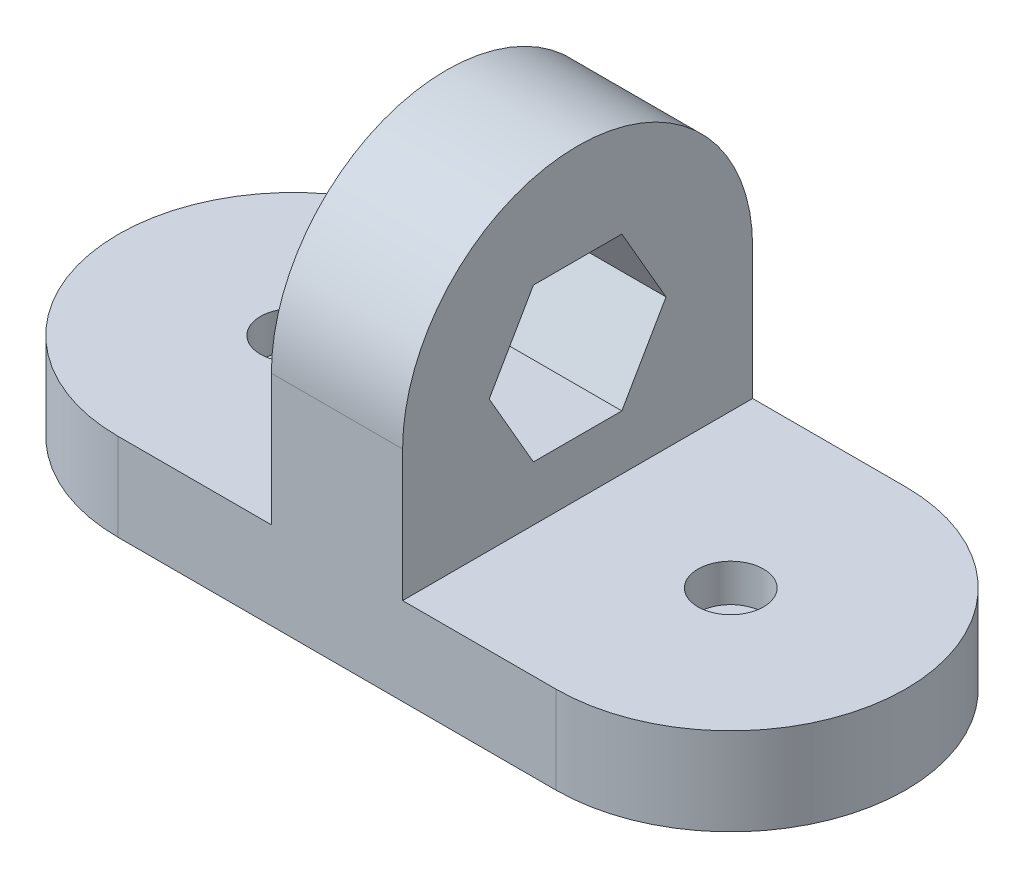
ISO-10303-21;
HEADER;
FILE_DESCRIPTION(('STEP AP214'),'2;1');
FILE_NAME('part.step','',(''),(''),'','','');
FILE_SCHEMA(('AUTOMOTIVE_DESIGN { 1 0 10303 214 1 1 1 1 }'));
ENDSEC;
DATA;
#1=APPLICATION_CONTEXT('core data for automotive mechanical design processes');
#2=APPLICATION_PROTOCOL_DEFINITION('international standard','automotive_design',2000,#1);
#3=PRODUCT_CONTEXT('',#1,'mechanical');
#4=PRODUCT('Part','Part','',(#3));
#5=PRODUCT_RELATED_PRODUCT_CATEGORY('part','',(#4));
#6=PRODUCT_DEFINITION_FORMATION('','',#4);
#7=PRODUCT_DEFINITION_CONTEXT('part definition',#1,'design');
#8=PRODUCT_DEFINITION('design','',#6,#7);
#9=PRODUCT_DEFINITION_SHAPE('','',#8);
#10=(LENGTH_UNIT() NAMED_UNIT(*) SI_UNIT(.MILLI.,.METRE.));
#11=(NAMED_UNIT(*) PLANE_ANGLE_UNIT() SI_UNIT($,.RADIAN.));
#12=(NAMED_UNIT(*) SI_UNIT($,.STERADIAN.) SOLID_ANGLE_UNIT());
#13=UNCERTAINTY_MEASURE_WITH_UNIT(LENGTH_MEASURE(1.E-05),#10,'distance_accuracy_value','');
#14=(GEOMETRIC_REPRESENTATION_CONTEXT(3) GLOBAL_UNCERTAINTY_ASSIGNED_CONTEXT((#13)) GLOBAL_UNIT_ASSIGNED_CONTEXT((#10,
#11,#12)) REPRESENTATION_CONTEXT('',''));
#15=CARTESIAN_POINT('',(0.,0.,0.));
#16=DIRECTION('',(0.,0.,1.));
#17=DIRECTION('',(1.,0.,0.));
#18=AXIS2_PLACEMENT_3D('',#15,#16,#17);
#19=CARTESIAN_POINT('',(-50.,20.,0.));
#20=DIRECTION('',(0.,1.,0.));
#21=DIRECTION('',(0.,0.,1.));
#22=AXIS2_PLACEMENT_3D('',#19,#20,#21);
#23=PLANE('',#22);
#24=CARTESIAN_POINT('',(-50.,20.,0.));
#25=DIRECTION('',(0.,1.,0.));
#26=DIRECTION('',(0.,0.,1.));
#27=AXIS2_PLACEMENT_3D('',#24,#25,#26);
#28=CIRCLE('',#27,7.49999999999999);
#29=CARTESIAN_POINT('',(-50.,20.,7.49999999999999));
#30=VERTEX_POINT('',#29);
#31=EDGE_CURVE('E213',#30,#30,#28,.T.);
#32=ORIENTED_EDGE('',*,*,#31,.F.);
#33=EDGE_LOOP('',(#32));
#34=FACE_BOUND('',#33,.T.);
#35=DIRECTION('',(1.,0.,0.));
#36=VECTOR('',#35,1.);
#37=CARTESIAN_POINT('',(-50.,20.,40.));
#38=LINE('',#37,#36);
#39=CARTESIAN_POINT('',(-50.,20.,40.));
#40=VERTEX_POINT('',#39);
#41=CARTESIAN_POINT('',(-15.,20.,40.));
#42=VERTEX_POINT('',#41);
#43=EDGE_CURVE('E243',#40,#42,#38,.T.);
#44=ORIENTED_EDGE('',*,*,#43,.T.);
#45=DIRECTION('',(0.,0.,-1.));
#46=VECTOR('',#45,1.);
#47=CARTESIAN_POINT('',(-15.,20.,-40.));
#48=LINE('',#47,#46);
#49=CARTESIAN_POINT('',(-15.,20.,-40.));
#50=VERTEX_POINT('',#49);
#51=EDGE_CURVE('E188',#42,#50,#48,.T.);
#52=ORIENTED_EDGE('',*,*,#51,.T.);
#53=DIRECTION('',(-1.,0.,0.));
#54=VECTOR('',#53,1.);
#55=CARTESIAN_POINT('',(-50.,20.,-40.));
#56=LINE('',#55,#54);
#57=CARTESIAN_POINT('',(-50.,20.,-40.));
#58=VERTEX_POINT('',#57);
#59=EDGE_CURVE('E247',#50,#58,#56,.T.);
#60=ORIENTED_EDGE('',*,*,#59,.T.);
#61=CARTESIAN_POINT('',(-50.,20.,0.));
#62=DIRECTION('',(0.,1.,0.));
#63=DIRECTION('',(0.,0.,1.));
#64=AXIS2_PLACEMENT_3D('',#61,#62,#63);
#65=CIRCLE('',#64,40.);
#66=EDGE_CURVE('E238',#58,#40,#65,.T.);
#67=ORIENTED_EDGE('',*,*,#66,.T.);
#68=EDGE_LOOP('',(#44,#52,#60,#67));
#69=FACE_BOUND('',#68,.T.);
#70=ADVANCED_FACE('F33',(#34,#69),#23,.T.);
#71=CARTESIAN_POINT('',(-50.,20.,0.));
#72=DIRECTION('',(0.,-1.,0.));
#73=DIRECTION('',(0.,0.,-1.));
#74=AXIS2_PLACEMENT_3D('',#71,#72,#73);
#75=CYLINDRICAL_SURFACE('',#74,40.);
#76=CARTESIAN_POINT('',(-50.,0.,0.));
#77=DIRECTION('',(0.,1.,0.));
#78=DIRECTION('',(0.,0.,1.));
#79=AXIS2_PLACEMENT_3D('',#76,#77,#78);
#80=CIRCLE('',#79,40.);
#81=CARTESIAN_POINT('',(-50.,0.,-40.));
#82=VERTEX_POINT('',#81);
#83=CARTESIAN_POINT('',(-50.,0.,40.));
#84=VERTEX_POINT('',#83);
#85=EDGE_CURVE('E237',#82,#84,#80,.T.);
#86=ORIENTED_EDGE('',*,*,#85,.T.);
#87=DIRECTION('',(0.,-1.,0.));
#88=VECTOR('',#87,1.);
#89=CARTESIAN_POINT('',(-50.,20.,40.));
#90=LINE('',#89,#88);
#91=EDGE_CURVE('E11',#40,#84,#90,.T.);
#92=ORIENTED_EDGE('',*,*,#91,.F.);
#93=ORIENTED_EDGE('',*,*,#66,.F.);
#94=DIRECTION('',(0.,-1.,0.));
#95=VECTOR('',#94,1.);
#96=CARTESIAN_POINT('',(-50.,20.,-40.));
#97=LINE('',#96,#95);
#98=EDGE_CURVE('E250',#58,#82,#97,.T.);
#99=ORIENTED_EDGE('',*,*,#98,.T.);
#100=EDGE_LOOP('',(#86,#92,#93,#99));
#101=FACE_BOUND('',#100,.T.);
#102=ADVANCED_FACE('F35',(#101),#75,.T.);
#103=CARTESIAN_POINT('',(-50.,20.,40.));
#104=DIRECTION('',(0.,0.,-1.));
#105=DIRECTION('',(-1.,0.,0.));
#106=AXIS2_PLACEMENT_3D('',#103,#104,#105);
#107=PLANE('',#106);
#108=DIRECTION('',(1.,0.,0.));
#109=VECTOR('',#108,1.);
#110=CARTESIAN_POINT('',(-50.,0.,40.));
#111=LINE('',#110,#109);
#112=CARTESIAN_POINT('',(50.,0.,40.));
#113=VERTEX_POINT('',#112);
#114=EDGE_CURVE('E253',#84,#113,#111,.T.);
#115=ORIENTED_EDGE('',*,*,#114,.T.);
#116=DIRECTION('',(0.,-1.,0.));
#117=VECTOR('',#116,1.);
#118=CARTESIAN_POINT('',(50.,20.,40.));
#119=LINE('',#118,#117);
#120=CARTESIAN_POINT('',(50.,20.,40.));
#121=VERTEX_POINT('',#120);
#122=EDGE_CURVE('E41',#121,#113,#119,.T.);
#123=ORIENTED_EDGE('',*,*,#122,.F.);
#124=CARTESIAN_POINT('',(15.,20.,40.));
#125=VERTEX_POINT('',#124);
#126=EDGE_CURVE('E241',#125,#121,#38,.T.);
#127=ORIENTED_EDGE('',*,*,#126,.F.);
#128=DIRECTION('',(0.,-1.,0.));
#129=VECTOR('',#128,1.);
#130=CARTESIAN_POINT('',(15.,20.,40.));
#131=LINE('',#130,#129);
#132=CARTESIAN_POINT('',(15.,50.,40.));
#133=VERTEX_POINT('',#132);
#134=EDGE_CURVE('E197',#133,#125,#131,.T.);
#135=ORIENTED_EDGE('',*,*,#134,.F.);
#136=DIRECTION('',(-1.,0.,0.));
#137=VECTOR('',#136,1.);
#138=CARTESIAN_POINT('',(15.,50.,40.));
#139=LINE('',#138,#137);
#140=CARTESIAN_POINT('',(-15.,50.,40.));
#141=VERTEX_POINT('',#140);
#142=EDGE_CURVE('E200',#133,#141,#139,.T.);
#143=ORIENTED_EDGE('',*,*,#142,.T.);
#144=DIRECTION('',(0.,-1.,0.));
#145=VECTOR('',#144,1.);
#146=CARTESIAN_POINT('',(-15.,20.,40.));
#147=LINE('',#146,#145);
#148=EDGE_CURVE('E193',#141,#42,#147,.T.);
#149=ORIENTED_EDGE('',*,*,#148,.T.);
#150=ORIENTED_EDGE('',*,*,#43,.F.);
#151=ORIENTED_EDGE('',*,*,#91,.T.);
#152=EDGE_LOOP('',(#115,#123,#127,#135,#143,#149,#150,#151));
#153=FACE_BOUND('',#152,.T.);
#154=ADVANCED_FACE('F294',(#153),#107,.F.);
#155=CARTESIAN_POINT('',(50.,20.,0.));
#156=DIRECTION('',(0.,-1.,0.));
#157=DIRECTION('',(0.,0.,-1.));
#158=AXIS2_PLACEMENT_3D('',#155,#156,#157);
#159=CYLINDRICAL_SURFACE('',#158,40.);
#160=CARTESIAN_POINT('',(50.,0.,0.));
#161=DIRECTION('',(0.,1.,0.));
#162=DIRECTION('',(0.,0.,1.));
#163=AXIS2_PLACEMENT_3D('',#160,#161,#162);
#164=CIRCLE('',#163,40.);
#165=CARTESIAN_POINT('',(50.,0.,-40.));
#166=VERTEX_POINT('',#165);
#167=EDGE_CURVE('E255',#113,#166,#164,.T.);
#168=ORIENTED_EDGE('',*,*,#167,.T.);
#169=DIRECTION('',(0.,-1.,0.));
#170=VECTOR('',#169,1.);
#171=CARTESIAN_POINT('',(50.,20.,-40.));
#172=LINE('',#171,#170);
#173=CARTESIAN_POINT('',(50.,20.,-40.));
#174=VERTEX_POINT('',#173);
#175=EDGE_CURVE('E260',#174,#166,#172,.T.);
#176=ORIENTED_EDGE('',*,*,#175,.F.);
#177=CARTESIAN_POINT('',(50.,20.,0.));
#178=DIRECTION('',(0.,1.,0.));
#179=DIRECTION('',(0.,0.,1.));
#180=AXIS2_PLACEMENT_3D('',#177,#178,#179);
#181=CIRCLE('',#180,40.);
#182=EDGE_CURVE('E245',#121,#174,#181,.T.);
#183=ORIENTED_EDGE('',*,*,#182,.F.);
#184=ORIENTED_EDGE('',*,*,#122,.T.);
#185=EDGE_LOOP('',(#168,#176,#183,#184));
#186=FACE_BOUND('',#185,.T.);
#187=ADVANCED_FACE('F267',(#186),#159,.T.);
#188=CARTESIAN_POINT('',(-50.,20.,-40.));
#189=DIRECTION('',(0.,0.,1.));
#190=DIRECTION('',(1.,0.,0.));
#191=AXIS2_PLACEMENT_3D('',#188,#189,#190);
#192=PLANE('',#191);
#193=DIRECTION('',(-1.,0.,0.));
#194=VECTOR('',#193,1.);
#195=CARTESIAN_POINT('',(-50.,0.,-40.));
#196=LINE('',#195,#194);
#197=EDGE_CURVE('E242',#166,#82,#196,.T.);
#198=ORIENTED_EDGE('',*,*,#197,.T.);
#199=ORIENTED_EDGE('',*,*,#98,.F.);
#200=ORIENTED_EDGE('',*,*,#59,.F.);
#201=DIRECTION('',(0.,1.,0.));
#202=VECTOR('',#201,1.);
#203=CARTESIAN_POINT('',(-15.,50.,-40.));
#204=LINE('',#203,#202);
#205=CARTESIAN_POINT('',(-15.,50.,-40.));
#206=VERTEX_POINT('',#205);
#207=EDGE_CURVE('E202',#50,#206,#204,.T.);
#208=ORIENTED_EDGE('',*,*,#207,.T.);
#209=DIRECTION('',(-1.,0.,0.));
#210=VECTOR('',#209,1.);
#211=CARTESIAN_POINT('',(15.,50.,-40.));
#212=LINE('',#211,#210);
#213=CARTESIAN_POINT('',(15.,50.,-40.));
#214=VERTEX_POINT('',#213);
#215=EDGE_CURVE('E210',#214,#206,#212,.T.);
#216=ORIENTED_EDGE('',*,*,#215,.F.);
#217=DIRECTION('',(0.,1.,0.));
#218=VECTOR('',#217,1.);
#219=CARTESIAN_POINT('',(15.,50.,-40.));
#220=LINE('',#219,#218);
#221=CARTESIAN_POINT('',(15.,20.,-40.));
#222=VERTEX_POINT('',#221);
#223=EDGE_CURVE('E192',#222,#214,#220,.T.);
#224=ORIENTED_EDGE('',*,*,#223,.F.);
#225=EDGE_CURVE('E248',#174,#222,#56,.T.);
#226=ORIENTED_EDGE('',*,*,#225,.F.);
#227=ORIENTED_EDGE('',*,*,#175,.T.);
#228=EDGE_LOOP('',(#198,#199,#200,#208,#216,#224,#226,#227));
#229=FACE_BOUND('',#228,.T.);
#230=ADVANCED_FACE('F277',(#229),#192,.F.);
#231=DIRECTION('',(0.,0.,-1.));
#232=VECTOR('',#231,1.);
#233=CARTESIAN_POINT('',(15.,20.,-40.));
#234=LINE('',#233,#232);
#235=EDGE_CURVE('E189',#125,#222,#234,.T.);
#236=ORIENTED_EDGE('',*,*,#235,.F.);
#237=ORIENTED_EDGE('',*,*,#126,.T.);
#238=ORIENTED_EDGE('',*,*,#182,.T.);
#239=ORIENTED_EDGE('',*,*,#225,.T.);
#240=EDGE_LOOP('',(#236,#237,#238,#239));
#241=FACE_BOUND('',#240,.T.);
#242=CARTESIAN_POINT('',(50.,20.,0.));
#243=DIRECTION('',(0.,1.,0.));
#244=DIRECTION('',(0.,0.,1.));
#245=AXIS2_PLACEMENT_3D('',#242,#243,#244);
#246=CIRCLE('',#245,7.49999999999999);
#247=CARTESIAN_POINT('',(50.,20.,7.49999999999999));
#248=VERTEX_POINT('',#247);
#249=EDGE_CURVE('E225',#248,#248,#246,.T.);
#250=ORIENTED_EDGE('',*,*,#249,.F.);
#251=EDGE_LOOP('',(#250));
#252=FACE_BOUND('',#251,.T.);
#253=ADVANCED_FACE('F299',(#241,#252),#23,.T.);
#254=CARTESIAN_POINT('',(-50.,0.,0.));
#255=DIRECTION('',(0.,1.,0.));
#256=DIRECTION('',(0.,0.,1.));
#257=AXIS2_PLACEMENT_3D('',#254,#255,#256);
#258=PLANE('',#257);
#259=CARTESIAN_POINT('',(-50.,0.,0.));
#260=DIRECTION('',(0.,1.,0.));
#261=DIRECTION('',(0.,0.,1.));
#262=AXIS2_PLACEMENT_3D('',#259,#260,#261);
#263=CIRCLE('',#262,4.5);
#264=CARTESIAN_POINT('',(-50.,0.,4.5));
#265=VERTEX_POINT('',#264);
#266=EDGE_CURVE('E222',#265,#265,#263,.T.);
#267=ORIENTED_EDGE('',*,*,#266,.T.);
#268=EDGE_LOOP('',(#267));
#269=FACE_BOUND('',#268,.T.);
#270=CARTESIAN_POINT('',(50.,0.,0.));
#271=DIRECTION('',(0.,1.,0.));
#272=DIRECTION('',(0.,0.,1.));
#273=AXIS2_PLACEMENT_3D('',#270,#271,#272);
#274=CIRCLE('',#273,4.5);
#275=CARTESIAN_POINT('',(50.,0.,4.5));
#276=VERTEX_POINT('',#275);
#277=EDGE_CURVE('E234',#276,#276,#274,.T.);
#278=ORIENTED_EDGE('',*,*,#277,.T.);
#279=EDGE_LOOP('',(#278));
#280=FACE_BOUND('',#279,.T.);
#281=ORIENTED_EDGE('',*,*,#85,.F.);
#282=ORIENTED_EDGE('',*,*,#197,.F.);
#283=ORIENTED_EDGE('',*,*,#167,.F.);
#284=ORIENTED_EDGE('',*,*,#114,.F.);
#285=EDGE_LOOP('',(#281,#282,#283,#284));
#286=FACE_BOUND('',#285,.T.);
#287=ADVANCED_FACE('F274',(#269,#280,#286),#258,.F.);
#288=CARTESIAN_POINT('',(50.,20.,0.));
#289=DIRECTION('',(0.,1.,0.));
#290=DIRECTION('',(0.,0.,1.));
#291=AXIS2_PLACEMENT_3D('',#288,#289,#290);
#292=CYLINDRICAL_SURFACE('',#291,4.5);
#293=ORIENTED_EDGE('',*,*,#277,.F.);
#294=EDGE_LOOP('',(#293));
#295=FACE_BOUND('',#294,.T.);
#296=CARTESIAN_POINT('',(50.,11.4,0.));
#297=DIRECTION('',(0.,1.,0.));
#298=DIRECTION('',(0.,0.,1.));
#299=AXIS2_PLACEMENT_3D('',#296,#297,#298);
#300=CIRCLE('',#299,4.5);
#301=CARTESIAN_POINT('',(50.,11.4,4.5));
#302=VERTEX_POINT('',#301);
#303=EDGE_CURVE('E231',#302,#302,#300,.T.);
#304=ORIENTED_EDGE('',*,*,#303,.T.);
#305=EDGE_LOOP('',(#304));
#306=FACE_BOUND('',#305,.T.);
#307=ADVANCED_FACE('F318',(#295,#306),#292,.F.);
#308=CARTESIAN_POINT('',(54.5,11.4,0.));
#309=DIRECTION('',(0.,-1.,0.));
#310=DIRECTION('',(0.,0.,-1.));
#311=AXIS2_PLACEMENT_3D('',#308,#309,#310);
#312=PLANE('',#311);
#313=ORIENTED_EDGE('',*,*,#303,.F.);
#314=EDGE_LOOP('',(#313));
#315=FACE_BOUND('',#314,.T.);
#316=CARTESIAN_POINT('',(50.,11.4,0.));
#317=DIRECTION('',(0.,1.,0.));
#318=DIRECTION('',(0.,0.,1.));
#319=AXIS2_PLACEMENT_3D('',#316,#317,#318);
#320=CIRCLE('',#319,7.5);
#321=CARTESIAN_POINT('',(50.,11.4,7.5));
#322=VERTEX_POINT('',#321);
#323=EDGE_CURVE('E228',#322,#322,#320,.T.);
#324=ORIENTED_EDGE('',*,*,#323,.T.);
#325=EDGE_LOOP('',(#324));
#326=FACE_BOUND('',#325,.T.);
#327=ADVANCED_FACE('F308',(#315,#326),#312,.F.);
#328=CARTESIAN_POINT('',(50.,20.,0.));
#329=DIRECTION('',(0.,1.,0.));
#330=DIRECTION('',(0.,0.,1.));
#331=AXIS2_PLACEMENT_3D('',#328,#329,#330);
#332=CYLINDRICAL_SURFACE('',#331,7.5);
#333=ORIENTED_EDGE('',*,*,#323,.F.);
#334=EDGE_LOOP('',(#333));
#335=FACE_BOUND('',#334,.T.);
#336=ORIENTED_EDGE('',*,*,#249,.T.);
#337=EDGE_LOOP('',(#336));
#338=FACE_BOUND('',#337,.T.);
#339=ADVANCED_FACE('F305',(#335,#338),#332,.F.);
#340=CARTESIAN_POINT('',(-50.,20.,0.));
#341=DIRECTION('',(0.,1.,0.));
#342=DIRECTION('',(0.,0.,1.));
#343=AXIS2_PLACEMENT_3D('',#340,#341,#342);
#344=CYLINDRICAL_SURFACE('',#343,4.5);
#345=ORIENTED_EDGE('',*,*,#266,.F.);
#346=EDGE_LOOP('',(#345));
#347=FACE_BOUND('',#346,.T.);
#348=CARTESIAN_POINT('',(-50.,11.4,0.));
#349=DIRECTION('',(0.,1.,0.));
#350=DIRECTION('',(0.,0.,1.));
#351=AXIS2_PLACEMENT_3D('',#348,#349,#350);
#352=CIRCLE('',#351,4.5);
#353=CARTESIAN_POINT('',(-50.,11.4,4.5));
#354=VERTEX_POINT('',#353);
#355=EDGE_CURVE('E219',#354,#354,#352,.T.);
#356=ORIENTED_EDGE('',*,*,#355,.T.);
#357=EDGE_LOOP('',(#356));
#358=FACE_BOUND('',#357,.T.);
#359=ADVANCED_FACE('F307',(#347,#358),#344,.F.);
#360=CARTESIAN_POINT('',(-45.5,11.4,0.));
#361=DIRECTION('',(0.,-1.,0.));
#362=DIRECTION('',(0.,0.,-1.));
#363=AXIS2_PLACEMENT_3D('',#360,#361,#362);
#364=PLANE('',#363);
#365=ORIENTED_EDGE('',*,*,#355,.F.);
#366=EDGE_LOOP('',(#365));
#367=FACE_BOUND('',#366,.T.);
#368=CARTESIAN_POINT('',(-50.,11.4,0.));
#369=DIRECTION('',(0.,1.,0.));
#370=DIRECTION('',(0.,0.,1.));
#371=AXIS2_PLACEMENT_3D('',#368,#369,#370);
#372=CIRCLE('',#371,7.5);
#373=CARTESIAN_POINT('',(-50.,11.4,7.5));
#374=VERTEX_POINT('',#373);
#375=EDGE_CURVE('E216',#374,#374,#372,.T.);
#376=ORIENTED_EDGE('',*,*,#375,.T.);
#377=EDGE_LOOP('',(#376));
#378=FACE_BOUND('',#377,.T.);
#379=ADVANCED_FACE('F315',(#367,#378),#364,.F.);
#380=CARTESIAN_POINT('',(-50.,20.,0.));
#381=DIRECTION('',(0.,1.,0.));
#382=DIRECTION('',(0.,0.,1.));
#383=AXIS2_PLACEMENT_3D('',#380,#381,#382);
#384=CYLINDRICAL_SURFACE('',#383,7.5);
#385=ORIENTED_EDGE('',*,*,#375,.F.);
#386=EDGE_LOOP('',(#385));
#387=FACE_BOUND('',#386,.T.);
#388=ORIENTED_EDGE('',*,*,#31,.T.);
#389=EDGE_LOOP('',(#388));
#390=FACE_BOUND('',#389,.T.);
#391=ADVANCED_FACE('F387',(#387,#390),#384,.F.);
#392=CARTESIAN_POINT('',(15.,50.,0.));
#393=DIRECTION('',(-1.,0.,0.));
#394=DIRECTION('',(0.,0.,1.));
#395=AXIS2_PLACEMENT_3D('',#392,#393,#394);
#396=CYLINDRICAL_SURFACE('',#395,40.);
#397=CARTESIAN_POINT('',(-15.,50.,0.));
#398=DIRECTION('',(1.,0.,0.));
#399=DIRECTION('',(0.,0.,1.));
#400=AXIS2_PLACEMENT_3D('',#397,#398,#399);
#401=CIRCLE('',#400,40.);
#402=EDGE_CURVE('E204',#206,#141,#401,.T.);
#403=ORIENTED_EDGE('',*,*,#402,.T.);
#404=ORIENTED_EDGE('',*,*,#142,.F.);
#405=CARTESIAN_POINT('',(15.,50.,0.));
#406=DIRECTION('',(1.,0.,0.));
#407=DIRECTION('',(0.,0.,1.));
#408=AXIS2_PLACEMENT_3D('',#405,#406,#407);
#409=CIRCLE('',#408,40.);
#410=EDGE_CURVE('E195',#214,#133,#409,.T.);
#411=ORIENTED_EDGE('',*,*,#410,.F.);
#412=ORIENTED_EDGE('',*,*,#215,.T.);
#413=EDGE_LOOP('',(#403,#404,#411,#412));
#414=FACE_BOUND('',#413,.T.);
#415=ADVANCED_FACE('F291',(#414),#396,.T.);
#416=CARTESIAN_POINT('',(15.,50.,0.));
#417=DIRECTION('',(-1.,0.,0.));
#418=DIRECTION('',(0.,0.,1.));
#419=AXIS2_PLACEMENT_3D('',#416,#417,#418);
#420=PLANE('',#419);
#421=DIRECTION('',(0.,-0.866025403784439,0.5));
#422=VECTOR('',#421,1.);
#423=CARTESIAN_POINT('',(15.,41.25,-15.1554445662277));
#424=LINE('',#423,#422);
#425=CARTESIAN_POINT('',(15.,50.,-20.2072594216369));
#426=VERTEX_POINT('',#425);
#427=CARTESIAN_POINT('',(15.,32.5,-10.1036297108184));
#428=VERTEX_POINT('',#427);
#429=EDGE_CURVE('E182',#426,#428,#424,.T.);
#430=ORIENTED_EDGE('',*,*,#429,.T.);
#431=DIRECTION('',(0.,0.,1.));
#432=VECTOR('',#431,1.);
#433=CARTESIAN_POINT('',(15.,32.5,0.));
#434=LINE('',#433,#432);
#435=CARTESIAN_POINT('',(15.,32.5,10.1036297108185));
#436=VERTEX_POINT('',#435);
#437=EDGE_CURVE('E185',#428,#436,#434,.T.);
#438=ORIENTED_EDGE('',*,*,#437,.T.);
#439=DIRECTION('',(0.,0.866025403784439,0.5));
#440=VECTOR('',#439,1.);
#441=CARTESIAN_POINT('',(15.,41.25,15.1554445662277));
#442=LINE('',#441,#440);
#443=CARTESIAN_POINT('',(15.,50.,20.2072594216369));
#444=VERTEX_POINT('',#443);
#445=EDGE_CURVE('E167',#436,#444,#442,.T.);
#446=ORIENTED_EDGE('',*,*,#445,.T.);
#447=DIRECTION('',(0.,0.866025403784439,-0.5));
#448=VECTOR('',#447,1.);
#449=CARTESIAN_POINT('',(15.,58.75,15.1554445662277));
#450=LINE('',#449,#448);
#451=CARTESIAN_POINT('',(15.,67.5,10.1036297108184));
#452=VERTEX_POINT('',#451);
#453=EDGE_CURVE('E140',#444,#452,#450,.T.);
#454=ORIENTED_EDGE('',*,*,#453,.T.);
#455=DIRECTION('',(0.,0.,-1.));
#456=VECTOR('',#455,1.);
#457=CARTESIAN_POINT('',(15.,67.5,0.));
#458=LINE('',#457,#456);
#459=CARTESIAN_POINT('',(15.,67.5,-10.1036297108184));
#460=VERTEX_POINT('',#459);
#461=EDGE_CURVE('E176',#452,#460,#458,.T.);
#462=ORIENTED_EDGE('',*,*,#461,.T.);
#463=DIRECTION('',(0.,-0.866025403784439,-0.5));
#464=VECTOR('',#463,1.);
#465=CARTESIAN_POINT('',(15.,58.75,-15.1554445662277));
#466=LINE('',#465,#464);
#467=EDGE_CURVE('E179',#460,#426,#466,.T.);
#468=ORIENTED_EDGE('',*,*,#467,.T.);
#469=EDGE_LOOP('',(#430,#438,#446,#454,#462,#468));
#470=FACE_BOUND('',#469,.T.);
#471=ORIENTED_EDGE('',*,*,#235,.T.);
#472=ORIENTED_EDGE('',*,*,#223,.T.);
#473=ORIENTED_EDGE('',*,*,#410,.T.);
#474=ORIENTED_EDGE('',*,*,#134,.T.);
#475=EDGE_LOOP('',(#471,#472,#473,#474));
#476=FACE_BOUND('',#475,.T.);
#477=ADVANCED_FACE('F296',(#470,#476),#420,.F.);
#478=CARTESIAN_POINT('',(-15.,50.,0.));
#479=DIRECTION('',(-1.,0.,0.));
#480=DIRECTION('',(0.,0.,1.));
#481=AXIS2_PLACEMENT_3D('',#478,#479,#480);
#482=PLANE('',#481);
#483=DIRECTION('',(0.,0.,1.));
#484=VECTOR('',#483,1.);
#485=CARTESIAN_POINT('',(-15.,32.5,-10.1036297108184));
#486=LINE('',#485,#484);
#487=CARTESIAN_POINT('',(-15.,32.5,-10.1036297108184));
#488=VERTEX_POINT('',#487);
#489=CARTESIAN_POINT('',(-15.,32.5,10.1036297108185));
#490=VERTEX_POINT('',#489);
#491=EDGE_CURVE('E56',#488,#490,#486,.T.);
#492=ORIENTED_EDGE('',*,*,#491,.F.);
#493=DIRECTION('',(0.,-0.866025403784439,0.5));
#494=VECTOR('',#493,1.);
#495=CARTESIAN_POINT('',(-15.,50.,-20.2072594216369));
#496=LINE('',#495,#494);
#497=CARTESIAN_POINT('',(-15.,50.,-20.2072594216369));
#498=VERTEX_POINT('',#497);
#499=EDGE_CURVE('E162',#498,#488,#496,.T.);
#500=ORIENTED_EDGE('',*,*,#499,.F.);
#501=DIRECTION('',(0.,-0.866025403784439,-0.5));
#502=VECTOR('',#501,1.);
#503=CARTESIAN_POINT('',(-15.,67.5,-10.1036297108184));
#504=LINE('',#503,#502);
#505=CARTESIAN_POINT('',(-15.,67.5,-10.1036297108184));
#506=VERTEX_POINT('',#505);
#507=EDGE_CURVE('E156',#506,#498,#504,.T.);
#508=ORIENTED_EDGE('',*,*,#507,.F.);
#509=DIRECTION('',(0.,0.,-1.));
#510=VECTOR('',#509,1.);
#511=CARTESIAN_POINT('',(-15.,67.5,10.1036297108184));
#512=LINE('',#511,#510);
#513=CARTESIAN_POINT('',(-15.,67.5,10.1036297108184));
#514=VERTEX_POINT('',#513);
#515=EDGE_CURVE('E154',#514,#506,#512,.T.);
#516=ORIENTED_EDGE('',*,*,#515,.F.);
#517=DIRECTION('',(0.,0.866025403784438,-0.5));
#518=VECTOR('',#517,1.);
#519=CARTESIAN_POINT('',(-15.,50.,20.2072594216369));
#520=LINE('',#519,#518);
#521=CARTESIAN_POINT('',(-15.,50.,20.2072594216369));
#522=VERTEX_POINT('',#521);
#523=EDGE_CURVE('E137',#522,#514,#520,.T.);
#524=ORIENTED_EDGE('',*,*,#523,.F.);
#525=DIRECTION('',(0.,0.866025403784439,0.5));
#526=VECTOR('',#525,1.);
#527=CARTESIAN_POINT('',(-15.,32.5,10.1036297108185));
#528=LINE('',#527,#526);
#529=EDGE_CURVE('E146',#490,#522,#528,.T.);
#530=ORIENTED_EDGE('',*,*,#529,.F.);
#531=EDGE_LOOP('',(#492,#500,#508,#516,#524,#530));
#532=FACE_BOUND('',#531,.T.);
#533=ORIENTED_EDGE('',*,*,#51,.F.);
#534=ORIENTED_EDGE('',*,*,#148,.F.);
#535=ORIENTED_EDGE('',*,*,#402,.F.);
#536=ORIENTED_EDGE('',*,*,#207,.F.);
#537=EDGE_LOOP('',(#533,#534,#535,#536));
#538=FACE_BOUND('',#537,.T.);
#539=ADVANCED_FACE('F150',(#532,#538),#482,.T.);
#540=CARTESIAN_POINT('',(90.,32.5,-10.1036297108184));
#541=DIRECTION('',(0.,-1.,0.));
#542=DIRECTION('',(0.,0.,-1.));
#543=AXIS2_PLACEMENT_3D('',#540,#541,#542);
#544=PLANE('',#543);
#545=DIRECTION('',(-1.,0.,0.));
#546=VECTOR('',#545,1.);
#547=CARTESIAN_POINT('',(90.,32.5,-10.1036297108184));
#548=LINE('',#547,#546);
#549=EDGE_CURVE('E165',#428,#488,#548,.T.);
#550=ORIENTED_EDGE('',*,*,#549,.T.);
#551=ORIENTED_EDGE('',*,*,#491,.T.);
#552=DIRECTION('',(-1.,0.,0.));
#553=VECTOR('',#552,1.);
#554=CARTESIAN_POINT('',(90.,32.5,10.1036297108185));
#555=LINE('',#554,#553);
#556=EDGE_CURVE('E143',#436,#490,#555,.T.);
#557=ORIENTED_EDGE('',*,*,#556,.F.);
#558=ORIENTED_EDGE('',*,*,#437,.F.);
#559=EDGE_LOOP('',(#550,#551,#557,#558));
#560=FACE_BOUND('',#559,.T.);
#561=ADVANCED_FACE('F436',(#560),#544,.F.);
#562=CARTESIAN_POINT('',(90.,50.,-20.2072594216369));
#563=DIRECTION('',(0.,-0.5,-0.866025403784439));
#564=DIRECTION('',(0.,0.866025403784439,-0.5));
#565=AXIS2_PLACEMENT_3D('',#562,#563,#564);
#566=PLANE('',#565);
#567=DIRECTION('',(-1.,0.,0.));
#568=VECTOR('',#567,1.);
#569=CARTESIAN_POINT('',(90.,50.,-20.2072594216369));
#570=LINE('',#569,#568);
#571=EDGE_CURVE('E168',#426,#498,#570,.T.);
#572=ORIENTED_EDGE('',*,*,#571,.T.);
#573=ORIENTED_EDGE('',*,*,#499,.T.);
#574=ORIENTED_EDGE('',*,*,#549,.F.);
#575=ORIENTED_EDGE('',*,*,#429,.F.);
#576=EDGE_LOOP('',(#572,#573,#574,#575));
#577=FACE_BOUND('',#576,.T.);
#578=ADVANCED_FACE('F444',(#577),#566,.F.);
#579=CARTESIAN_POINT('',(90.,67.5,-10.1036297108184));
#580=DIRECTION('',(0.,0.5,-0.866025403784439));
#581=DIRECTION('',(0.,0.866025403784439,0.5));
#582=AXIS2_PLACEMENT_3D('',#579,#580,#581);
#583=PLANE('',#582);
#584=DIRECTION('',(-1.,0.,0.));
#585=VECTOR('',#584,1.);
#586=CARTESIAN_POINT('',(90.,67.5,-10.1036297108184));
#587=LINE('',#586,#585);
#588=EDGE_CURVE('E170',#460,#506,#587,.T.);
#589=ORIENTED_EDGE('',*,*,#588,.T.);
#590=ORIENTED_EDGE('',*,*,#507,.T.);
#591=ORIENTED_EDGE('',*,*,#571,.F.);
#592=ORIENTED_EDGE('',*,*,#467,.F.);
#593=EDGE_LOOP('',(#589,#590,#591,#592));
#594=FACE_BOUND('',#593,.T.);
#595=ADVANCED_FACE('F452',(#594),#583,.F.);
#596=CARTESIAN_POINT('',(90.,67.5,10.1036297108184));
#597=DIRECTION('',(0.,1.,0.));
#598=DIRECTION('',(0.,0.,1.));
#599=AXIS2_PLACEMENT_3D('',#596,#597,#598);
#600=PLANE('',#599);
#601=DIRECTION('',(-1.,0.,0.));
#602=VECTOR('',#601,1.);
#603=CARTESIAN_POINT('',(90.,67.5,10.1036297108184));
#604=LINE('',#603,#602);
#605=EDGE_CURVE('E142',#452,#514,#604,.T.);
#606=ORIENTED_EDGE('',*,*,#605,.T.);
#607=ORIENTED_EDGE('',*,*,#515,.T.);
#608=ORIENTED_EDGE('',*,*,#588,.F.);
#609=ORIENTED_EDGE('',*,*,#461,.F.);
#610=EDGE_LOOP('',(#606,#607,#608,#609));
#611=FACE_BOUND('',#610,.T.);
#612=ADVANCED_FACE('F461',(#611),#600,.F.);
#613=CARTESIAN_POINT('',(90.,50.,20.2072594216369));
#614=DIRECTION('',(0.,0.5,0.866025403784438));
#615=DIRECTION('',(0.,-0.866025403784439,0.5));
#616=AXIS2_PLACEMENT_3D('',#613,#614,#615);
#617=PLANE('',#616);
#618=DIRECTION('',(-1.,0.,0.));
#619=VECTOR('',#618,1.);
#620=CARTESIAN_POINT('',(90.,50.,20.2072594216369));
#621=LINE('',#620,#619);
#622=EDGE_CURVE('E48',#444,#522,#621,.T.);
#623=ORIENTED_EDGE('',*,*,#622,.T.);
#624=ORIENTED_EDGE('',*,*,#523,.T.);
#625=ORIENTED_EDGE('',*,*,#605,.F.);
#626=ORIENTED_EDGE('',*,*,#453,.F.);
#627=EDGE_LOOP('',(#623,#624,#625,#626));
#628=FACE_BOUND('',#627,.T.);
#629=ADVANCED_FACE('F134',(#628),#617,.F.);
#630=CARTESIAN_POINT('',(90.,32.5,10.1036297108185));
#631=DIRECTION('',(0.,-0.499999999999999,0.866025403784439));
#632=DIRECTION('',(0.,-0.866025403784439,-0.5));
#633=AXIS2_PLACEMENT_3D('',#630,#631,#632);
#634=PLANE('',#633);
#635=ORIENTED_EDGE('',*,*,#556,.T.);
#636=ORIENTED_EDGE('',*,*,#529,.T.);
#637=ORIENTED_EDGE('',*,*,#622,.F.);
#638=ORIENTED_EDGE('',*,*,#445,.F.);
#639=EDGE_LOOP('',(#635,#636,#637,#638));
#640=FACE_BOUND('',#639,.T.);
#641=ADVANCED_FACE('F147',(#640),#634,.F.);
#642=CLOSED_SHELL('',(#70,#102,#154,#187,#230,#253,#287,#307,#327,#339,#359,#379,#391,#415,#477,
#539,#561,#578,#595,#612,#629,#641));
#643=MANIFOLD_SOLID_BREP('B2',#642);
#644=ADVANCED_BREP_SHAPE_REPRESENTATION('',(#18,#643),#14);
#645=SHAPE_DEFINITION_REPRESENTATION(#9,#644);
ENDSEC;
END-ISO-10303-21;
